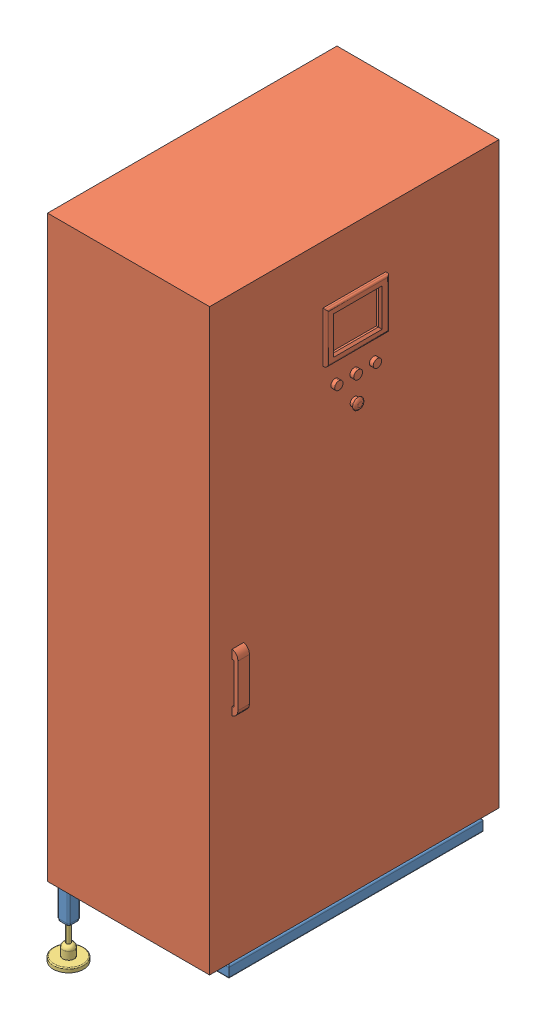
SolidWorks assembly 14D049 ARMOIRE THALASSA+BATI.SLDASM, configuration Default (file format 10000). Lengths in mm.
Overall size (480.8 1711 750).
4 component instances, 3 part files, 7 mates.
Components (placement in the parent):
- 14D048 BATI ARMOIRE THALASSA-1: 14D048 BATI ARMOIRE THALASSA.SLDPRT [Défaut<Brut d'usinage>] at (-280.751 102.2846 -401.9554) size (445 120 658.74)
- 14D045 ARMOIRE THALASSA-2: 14D045 ARMOIRE THALASSA.SLDPRT [Défaut] at (137.4024 -252.2996 419.0446) x (0 0 -1) z (1 0 0) size (750 1500 435)
- 14D053 pied bati-1: 14D053 pied bati.SLDPRT [Défaut] at (-288.8976 -463.2996 358.3446) size (79 166 79)
- 14D053 pied bati-2: 14D053 pied bati.SLDPRT [Défaut] at (-288.8976 -463.2996 -270.3905) size (79 166 79)
Mates (geometry in assembly coordinates):
- Coïncidente1: coincident anti-aligned: plane of 14D048 BATI ARMOIRE THALASSA-1 through (115.4024 -252.2996 -270.6905) normal (0 1 0); plane of 14D045 ARMOIRE THALASSA-2 through (-282.5976 -252.2996 419.0446) normal (0 -1 0)
- Coïncidente2: coincident anti-aligned: line of 14D048 BATI ARMOIRE THALASSA-1 through (137.4024 -252.2996 -281.6905) axis (0 0 1); line of 14D045 ARMOIRE THALASSA-2 through (137.4024 -252.2996 419.0446) axis (0 0 -1)
- Distance1: distance = 50 mm: line of 14D048 BATI ARMOIRE THALASSA-1 through (137.4024 -252.2996 369.0446) axis (-1 0 0); line of 14D045 ARMOIRE THALASSA-2 through (-282.5976 -252.2996 419.0446) axis (1 0 0)
- Coaxiale1: concentric aligned: cylinder of 14D048 BATI ARMOIRE THALASSA-1 through (-288.8976 -372.2996 358.3446) axis (0 -1 0) radius 6.75; cylinder of 14D053 pied bati-1 through (-288.8976 -297.2996 358.3446) axis (0 -1 0) radius 6
- Coaxiale2: concentric aligned: cylinder of 14D048 BATI ARMOIRE THALASSA-1 through (-288.8976 -372.2996 -270.3905) axis (0 -1 0) radius 6.75; cylinder of 14D053 pied bati-2 through (-288.8976 -297.2996 -270.3905) axis (0 -1 0) radius 6
- Distance2: distance = 80 mm anti-aligned: plane of 14D053 pied bati-1 through (-288.8976 -452.2996 358.3446) normal (0 1 0); plane of 14D048 BATI ARMOIRE THALASSA-1 through (-274.5976 -372.2996 372.0446) normal (0 -1 0)
- Distance3: distance = 80 mm anti-aligned: plane of 14D053 pied bati-2 through (-288.8976 -452.2996 -270.3905) normal (0 1 0); plane of 14D048 BATI ARMOIRE THALASSA-1 through (-274.5976 -372.2996 -256.6905) normal (0 -1 0)
